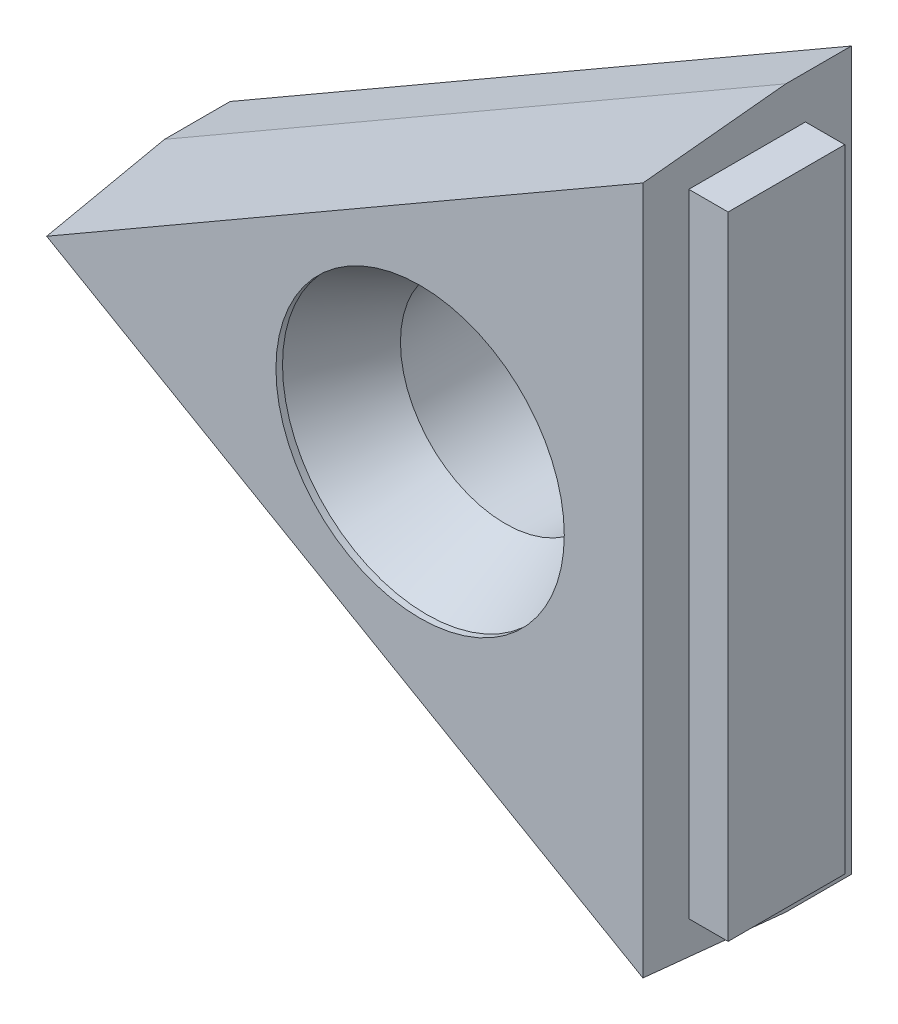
ISO-10303-21;
HEADER;
FILE_DESCRIPTION(('STEP AP214'),'2;1');
FILE_NAME('part.step','',(''),(''),'','','');
FILE_SCHEMA(('AUTOMOTIVE_DESIGN { 1 0 10303 214 1 1 1 1 }'));
ENDSEC;
DATA;
#1=APPLICATION_CONTEXT('core data for automotive mechanical design processes');
#2=APPLICATION_PROTOCOL_DEFINITION('international standard','automotive_design',2000,#1);
#3=PRODUCT_CONTEXT('',#1,'mechanical');
#4=PRODUCT('Part','Part','',(#3));
#5=PRODUCT_RELATED_PRODUCT_CATEGORY('part','',(#4));
#6=PRODUCT_DEFINITION_FORMATION('','',#4);
#7=PRODUCT_DEFINITION_CONTEXT('part definition',#1,'design');
#8=PRODUCT_DEFINITION('design','',#6,#7);
#9=PRODUCT_DEFINITION_SHAPE('','',#8);
#10=(LENGTH_UNIT() NAMED_UNIT(*) SI_UNIT(.MILLI.,.METRE.));
#11=(NAMED_UNIT(*) PLANE_ANGLE_UNIT() SI_UNIT($,.RADIAN.));
#12=(NAMED_UNIT(*) SI_UNIT($,.STERADIAN.) SOLID_ANGLE_UNIT());
#13=UNCERTAINTY_MEASURE_WITH_UNIT(LENGTH_MEASURE(1.E-05),#10,'distance_accuracy_value','');
#14=(GEOMETRIC_REPRESENTATION_CONTEXT(3) GLOBAL_UNCERTAINTY_ASSIGNED_CONTEXT((#13)) GLOBAL_UNIT_ASSIGNED_CONTEXT((#10,
#11,#12)) REPRESENTATION_CONTEXT('',''));
#15=CARTESIAN_POINT('',(0.,0.,0.));
#16=DIRECTION('',(0.,0.,1.));
#17=DIRECTION('',(1.,0.,0.));
#18=AXIS2_PLACEMENT_3D('',#15,#16,#17);
#19=CARTESIAN_POINT('',(0.,0.,0.));
#20=DIRECTION('',(0.,0.,1.));
#21=DIRECTION('',(0.,1.,0.));
#22=AXIS2_PLACEMENT_3D('',#19,#20,#21);
#23=CYLINDRICAL_SURFACE('',#22,1.6);
#24=CARTESIAN_POINT('',(0.,0.,0.));
#25=DIRECTION('',(0.,0.,1.));
#26=DIRECTION('',(0.,1.,0.));
#27=AXIS2_PLACEMENT_3D('',#24,#25,#26);
#28=CIRCLE('',#27,1.6);
#29=CARTESIAN_POINT('',(0.,1.6,0.));
#30=VERTEX_POINT('',#29);
#31=EDGE_CURVE('E18',#30,#30,#28,.F.);
#32=ORIENTED_EDGE('',*,*,#31,.T.);
#33=EDGE_LOOP('',(#32));
#34=FACE_BOUND('',#33,.T.);
#35=CARTESIAN_POINT('',(0.,0.,1.88));
#36=DIRECTION('',(0.,0.,1.));
#37=DIRECTION('',(1.,0.,0.));
#38=AXIS2_PLACEMENT_3D('',#35,#36,#37);
#39=CIRCLE('',#38,1.6);
#40=CARTESIAN_POINT('',(1.6,0.,1.88));
#41=VERTEX_POINT('',#40);
#42=EDGE_CURVE('E157',#41,#41,#39,.T.);
#43=ORIENTED_EDGE('',*,*,#42,.T.);
#44=EDGE_LOOP('',(#43));
#45=FACE_BOUND('',#44,.T.);
#46=ADVANCED_FACE('F14',(#34,#45),#23,.F.);
#47=CARTESIAN_POINT('',(4.,-5.81969071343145,3.18));
#48=DIRECTION('',(-1.,0.,0.));
#49=DIRECTION('',(0.,-1.,0.));
#50=AXIS2_PLACEMENT_3D('',#47,#48,#49);
#51=PLANE('',#50);
#52=DIRECTION('',(0.,-1.,0.));
#53=VECTOR('',#52,1.);
#54=CARTESIAN_POINT('',(3.99999999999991,-4.81969071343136,0.7));
#55=LINE('',#54,#53);
#56=CARTESIAN_POINT('',(3.99999999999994,4.81969071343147,0.7));
#57=VERTEX_POINT('',#56);
#58=CARTESIAN_POINT('',(4.,-4.81969071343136,0.7));
#59=VERTEX_POINT('',#58);
#60=EDGE_CURVE('E99',#57,#59,#55,.T.);
#61=ORIENTED_EDGE('',*,*,#60,.F.);
#62=DIRECTION('',(0.,0.,1.));
#63=VECTOR('',#62,1.);
#64=CARTESIAN_POINT('',(3.99999999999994,4.81969071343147,2.48));
#65=LINE('',#64,#63);
#66=CARTESIAN_POINT('',(4.,4.81969071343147,2.48));
#67=VERTEX_POINT('',#66);
#68=EDGE_CURVE('E81',#67,#57,#65,.F.);
#69=ORIENTED_EDGE('',*,*,#68,.F.);
#70=DIRECTION('',(0.,1.,0.));
#71=VECTOR('',#70,1.);
#72=CARTESIAN_POINT('',(4.,-4.81969071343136,2.48));
#73=LINE('',#72,#71);
#74=CARTESIAN_POINT('',(4.,-4.81969071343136,2.48));
#75=VERTEX_POINT('',#74);
#76=EDGE_CURVE('E88',#75,#67,#73,.T.);
#77=ORIENTED_EDGE('',*,*,#76,.F.);
#78=DIRECTION('',(0.,0.,1.));
#79=VECTOR('',#78,1.);
#80=CARTESIAN_POINT('',(4.,-4.81969071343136,2.48));
#81=LINE('',#80,#79);
#82=EDGE_CURVE('E107',#59,#75,#81,.T.);
#83=ORIENTED_EDGE('',*,*,#82,.F.);
#84=EDGE_LOOP('',(#61,#69,#77,#83));
#85=FACE_BOUND('',#84,.T.);
#86=ADVANCED_FACE('F16',(#85),#51,.F.);
#87=CARTESIAN_POINT('',(3.4,-4.81969071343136,2.48));
#88=DIRECTION('',(0.,0.,1.));
#89=DIRECTION('',(0.,1.,0.));
#90=AXIS2_PLACEMENT_3D('',#87,#88,#89);
#91=PLANE('',#90);
#92=DIRECTION('',(0.,1.,0.));
#93=VECTOR('',#92,1.);
#94=CARTESIAN_POINT('',(3.39999999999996,0.,2.48));
#95=LINE('',#94,#93);
#96=CARTESIAN_POINT('',(3.39999999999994,-4.81969071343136,2.48));
#97=VERTEX_POINT('',#96);
#98=CARTESIAN_POINT('',(3.39999999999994,4.81969071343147,2.48));
#99=VERTEX_POINT('',#98);
#100=EDGE_CURVE('E129',#97,#99,#95,.T.);
#101=ORIENTED_EDGE('',*,*,#100,.F.);
#102=DIRECTION('',(1.,0.,0.));
#103=VECTOR('',#102,1.);
#104=CARTESIAN_POINT('',(3.4,-4.81969071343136,2.48));
#105=LINE('',#104,#103);
#106=EDGE_CURVE('E93',#75,#97,#105,.F.);
#107=ORIENTED_EDGE('',*,*,#106,.F.);
#108=ORIENTED_EDGE('',*,*,#76,.T.);
#109=DIRECTION('',(-1.,0.,0.));
#110=VECTOR('',#109,1.);
#111=CARTESIAN_POINT('',(3.39999999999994,4.81969071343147,2.48));
#112=LINE('',#111,#110);
#113=EDGE_CURVE('E91',#99,#67,#112,.F.);
#114=ORIENTED_EDGE('',*,*,#113,.F.);
#115=EDGE_LOOP('',(#101,#107,#108,#114));
#116=FACE_BOUND('',#115,.T.);
#117=ADVANCED_FACE('F90',(#116),#91,.T.);
#118=CARTESIAN_POINT('',(3.39999999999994,4.81969071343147,2.48));
#119=DIRECTION('',(0.,1.,0.));
#120=DIRECTION('',(-1.,0.,0.));
#121=AXIS2_PLACEMENT_3D('',#118,#119,#120);
#122=PLANE('',#121);
#123=DIRECTION('',(0.,0.,1.));
#124=VECTOR('',#123,1.);
#125=CARTESIAN_POINT('',(3.39999999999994,4.81969071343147,1.59));
#126=LINE('',#125,#124);
#127=CARTESIAN_POINT('',(3.39999999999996,4.81969071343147,0.7));
#128=VERTEX_POINT('',#127);
#129=EDGE_CURVE('E98',#99,#128,#126,.F.);
#130=ORIENTED_EDGE('',*,*,#129,.F.);
#131=ORIENTED_EDGE('',*,*,#113,.T.);
#132=ORIENTED_EDGE('',*,*,#68,.T.);
#133=DIRECTION('',(-1.,0.,0.));
#134=VECTOR('',#133,1.);
#135=CARTESIAN_POINT('',(3.4,4.81969071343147,0.7));
#136=LINE('',#135,#134);
#137=EDGE_CURVE('E105',#128,#57,#136,.F.);
#138=ORIENTED_EDGE('',*,*,#137,.F.);
#139=EDGE_LOOP('',(#130,#131,#132,#138));
#140=FACE_BOUND('',#139,.T.);
#141=ADVANCED_FACE('F97',(#140),#122,.T.);
#142=CARTESIAN_POINT('',(3.4,-4.81969071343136,0.7));
#143=DIRECTION('',(0.,0.,-1.));
#144=DIRECTION('',(0.,-1.,0.));
#145=AXIS2_PLACEMENT_3D('',#142,#143,#144);
#146=PLANE('',#145);
#147=DIRECTION('',(0.,1.,0.));
#148=VECTOR('',#147,1.);
#149=CARTESIAN_POINT('',(3.39999999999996,0.,0.7));
#150=LINE('',#149,#148);
#151=CARTESIAN_POINT('',(3.4,-4.81969071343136,0.7));
#152=VERTEX_POINT('',#151);
#153=EDGE_CURVE('E132',#128,#152,#150,.F.);
#154=ORIENTED_EDGE('',*,*,#153,.F.);
#155=ORIENTED_EDGE('',*,*,#137,.T.);
#156=ORIENTED_EDGE('',*,*,#60,.T.);
#157=DIRECTION('',(1.,0.,0.));
#158=VECTOR('',#157,1.);
#159=CARTESIAN_POINT('',(3.4,-4.81969071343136,0.7));
#160=LINE('',#159,#158);
#161=EDGE_CURVE('E110',#152,#59,#160,.T.);
#162=ORIENTED_EDGE('',*,*,#161,.F.);
#163=EDGE_LOOP('',(#154,#155,#156,#162));
#164=FACE_BOUND('',#163,.T.);
#165=ADVANCED_FACE('F226',(#164),#146,.T.);
#166=CARTESIAN_POINT('',(3.4,-4.81969071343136,2.48));
#167=DIRECTION('',(0.,-1.,0.));
#168=DIRECTION('',(1.,0.,0.));
#169=AXIS2_PLACEMENT_3D('',#166,#167,#168);
#170=PLANE('',#169);
#171=DIRECTION('',(0.,0.,1.));
#172=VECTOR('',#171,1.);
#173=CARTESIAN_POINT('',(3.4,-4.81969071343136,1.59));
#174=LINE('',#173,#172);
#175=EDGE_CURVE('E134',#152,#97,#174,.T.);
#176=ORIENTED_EDGE('',*,*,#175,.F.);
#177=ORIENTED_EDGE('',*,*,#161,.T.);
#178=ORIENTED_EDGE('',*,*,#82,.T.);
#179=ORIENTED_EDGE('',*,*,#106,.T.);
#180=EDGE_LOOP('',(#176,#177,#178,#179));
#181=FACE_BOUND('',#180,.T.);
#182=ADVANCED_FACE('F218',(#181),#170,.T.);
#183=CARTESIAN_POINT('',(-6.08000000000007,0.,1.));
#184=DIRECTION('',(0.498097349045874,-0.86272991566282,-0.0871557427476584));
#185=DIRECTION('',(0.866025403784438,0.5,0.));
#186=AXIS2_PLACEMENT_3D('',#183,#184,#185);
#187=PLANE('',#186);
#188=DIRECTION('',(0.,-0.100511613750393,0.994935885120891));
#189=VECTOR('',#188,1.);
#190=CARTESIAN_POINT('',(3.39999999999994,5.47328055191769,1.));
#191=LINE('',#190,#189);
#192=CARTESIAN_POINT('',(3.39999999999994,5.47328055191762,1.00000000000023));
#193=VERTEX_POINT('',#192);
#194=CARTESIAN_POINT('',(3.39999999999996,5.25304996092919,3.18));
#195=VERTEX_POINT('',#194);
#196=EDGE_CURVE('E141',#193,#195,#191,.T.);
#197=ORIENTED_EDGE('',*,*,#196,.F.);
#198=DIRECTION('',(0.866025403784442,0.5,0.));
#199=VECTOR('',#198,1.);
#200=CARTESIAN_POINT('',(3.99999999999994,5.81969071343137,1.));
#201=LINE('',#200,#199);
#202=CARTESIAN_POINT('',(-6.08000000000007,0.,1.));
#203=VERTEX_POINT('',#202);
#204=EDGE_CURVE('E121',#193,#203,#201,.F.);
#205=ORIENTED_EDGE('',*,*,#204,.T.);
#206=DIRECTION('',(0.17235866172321,0.,0.985034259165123));
#207=VECTOR('',#206,1.);
#208=CARTESIAN_POINT('',(-6.08000000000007,0.,1.));
#209=LINE('',#208,#207);
#210=CARTESIAN_POINT('',(-5.69854942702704,0.,3.18));
#211=VERTEX_POINT('',#210);
#212=EDGE_CURVE('E115',#203,#211,#209,.T.);
#213=ORIENTED_EDGE('',*,*,#212,.T.);
#214=DIRECTION('',(-0.866025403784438,-0.5,0.));
#215=VECTOR('',#214,1.);
#216=CARTESIAN_POINT('',(3.39999999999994,5.25304996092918,3.18));
#217=LINE('',#216,#215);
#218=EDGE_CURVE('E113',#195,#211,#217,.T.);
#219=ORIENTED_EDGE('',*,*,#218,.F.);
#220=EDGE_LOOP('',(#197,#205,#213,#219));
#221=FACE_BOUND('',#220,.T.);
#222=ADVANCED_FACE('F216',(#221),#187,.F.);
#223=CARTESIAN_POINT('',(-6.08000000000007,0.,3.18));
#224=DIRECTION('',(0.,0.,1.));
#225=DIRECTION('',(0.,1.,0.));
#226=AXIS2_PLACEMENT_3D('',#223,#224,#225);
#227=PLANE('',#226);
#228=CARTESIAN_POINT('',(0.,0.,3.18));
#229=DIRECTION('',(0.,0.,1.));
#230=DIRECTION('',(1.,0.,0.));
#231=AXIS2_PLACEMENT_3D('',#228,#229,#230);
#232=CIRCLE('',#231,2.2);
#233=CARTESIAN_POINT('',(2.2,0.,3.18));
#234=VERTEX_POINT('',#233);
#235=EDGE_CURVE('E96',#234,#234,#232,.T.);
#236=ORIENTED_EDGE('',*,*,#235,.F.);
#237=EDGE_LOOP('',(#236));
#238=FACE_BOUND('',#237,.T.);
#239=DIRECTION('',(0.,1.,0.));
#240=VECTOR('',#239,1.);
#241=CARTESIAN_POINT('',(3.39999999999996,0.,3.18));
#242=LINE('',#241,#240);
#243=CARTESIAN_POINT('',(3.4,-5.25304996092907,3.18));
#244=VERTEX_POINT('',#243);
#245=EDGE_CURVE('E143',#195,#244,#242,.F.);
#246=ORIENTED_EDGE('',*,*,#245,.F.);
#247=ORIENTED_EDGE('',*,*,#218,.T.);
#248=DIRECTION('',(-0.866025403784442,0.5,0.));
#249=VECTOR('',#248,1.);
#250=CARTESIAN_POINT('',(5.80493755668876,-6.64154130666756,3.18));
#251=LINE('',#250,#249);
#252=EDGE_CURVE('E118',#211,#244,#251,.F.);
#253=ORIENTED_EDGE('',*,*,#252,.T.);
#254=EDGE_LOOP('',(#246,#247,#253));
#255=FACE_BOUND('',#254,.T.);
#256=ADVANCED_FACE('F204',(#238,#255),#227,.T.);
#257=CARTESIAN_POINT('',(5.7095749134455,-6.80671424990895,1.));
#258=DIRECTION('',(0.498097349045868,0.862729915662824,-0.0871557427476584));
#259=DIRECTION('',(-0.866025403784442,0.5,0.));
#260=AXIS2_PLACEMENT_3D('',#257,#258,#259);
#261=PLANE('',#260);
#262=DIRECTION('',(0.,-0.100511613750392,-0.994935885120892));
#263=VECTOR('',#262,1.);
#264=CARTESIAN_POINT('',(3.4,-5.25304996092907,3.18));
#265=LINE('',#264,#263);
#266=CARTESIAN_POINT('',(3.39999999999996,-5.47328055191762,0.999999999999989));
#267=VERTEX_POINT('',#266);
#268=EDGE_CURVE('E145',#244,#267,#265,.T.);
#269=ORIENTED_EDGE('',*,*,#268,.F.);
#270=ORIENTED_EDGE('',*,*,#252,.F.);
#271=ORIENTED_EDGE('',*,*,#212,.F.);
#272=DIRECTION('',(-0.866025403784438,0.5,0.));
#273=VECTOR('',#272,1.);
#274=CARTESIAN_POINT('',(-6.08000000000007,0.,1.));
#275=LINE('',#274,#273);
#276=EDGE_CURVE('E127',#203,#267,#275,.F.);
#277=ORIENTED_EDGE('',*,*,#276,.T.);
#278=EDGE_LOOP('',(#269,#270,#271,#277));
#279=FACE_BOUND('',#278,.T.);
#280=ADVANCED_FACE('F199',(#279),#261,.F.);
#281=CARTESIAN_POINT('',(3.99999999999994,5.81969071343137,3.18));
#282=DIRECTION('',(0.5,-0.866025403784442,0.));
#283=DIRECTION('',(0.866025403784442,0.5,0.));
#284=AXIS2_PLACEMENT_3D('',#281,#282,#283);
#285=PLANE('',#284);
#286=DIRECTION('',(-0.866025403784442,-0.5,0.));
#287=VECTOR('',#286,1.);
#288=CARTESIAN_POINT('',(3.39999999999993,5.4732805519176,0.));
#289=LINE('',#288,#287);
#290=CARTESIAN_POINT('',(3.39999999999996,5.47328055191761,0.));
#291=VERTEX_POINT('',#290);
#292=CARTESIAN_POINT('',(-6.08000000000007,0.,0.));
#293=VERTEX_POINT('',#292);
#294=EDGE_CURVE('E147',#291,#293,#289,.T.);
#295=ORIENTED_EDGE('',*,*,#294,.T.);
#296=DIRECTION('',(0.,0.,1.));
#297=VECTOR('',#296,1.);
#298=CARTESIAN_POINT('',(-6.08000000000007,0.,3.18));
#299=LINE('',#298,#297);
#300=EDGE_CURVE('E124',#293,#203,#299,.T.);
#301=ORIENTED_EDGE('',*,*,#300,.T.);
#302=ORIENTED_EDGE('',*,*,#204,.F.);
#303=DIRECTION('',(0.,0.,1.));
#304=VECTOR('',#303,1.);
#305=CARTESIAN_POINT('',(3.39999999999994,5.4732805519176,1.59));
#306=LINE('',#305,#304);
#307=EDGE_CURVE('E138',#291,#193,#306,.T.);
#308=ORIENTED_EDGE('',*,*,#307,.F.);
#309=EDGE_LOOP('',(#295,#301,#302,#308));
#310=FACE_BOUND('',#309,.T.);
#311=ADVANCED_FACE('F196',(#310),#285,.F.);
#312=CARTESIAN_POINT('',(-6.08000000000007,0.,3.18));
#313=DIRECTION('',(0.5,0.866025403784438,0.));
#314=DIRECTION('',(-0.866025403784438,0.5,0.));
#315=AXIS2_PLACEMENT_3D('',#312,#313,#314);
#316=PLANE('',#315);
#317=ORIENTED_EDGE('',*,*,#276,.F.);
#318=ORIENTED_EDGE('',*,*,#300,.F.);
#319=DIRECTION('',(0.866025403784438,-0.5,0.));
#320=VECTOR('',#319,1.);
#321=CARTESIAN_POINT('',(-6.08000000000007,0.,0.));
#322=LINE('',#321,#320);
#323=CARTESIAN_POINT('',(3.39999999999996,-5.47328055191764,0.));
#324=VERTEX_POINT('',#323);
#325=EDGE_CURVE('E24',#293,#324,#322,.T.);
#326=ORIENTED_EDGE('',*,*,#325,.T.);
#327=DIRECTION('',(0.,0.,1.));
#328=VECTOR('',#327,1.);
#329=CARTESIAN_POINT('',(3.4,-5.47328055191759,1.59));
#330=LINE('',#329,#328);
#331=EDGE_CURVE('E32',#267,#324,#330,.F.);
#332=ORIENTED_EDGE('',*,*,#331,.F.);
#333=EDGE_LOOP('',(#317,#318,#326,#332));
#334=FACE_BOUND('',#333,.T.);
#335=ADVANCED_FACE('F190',(#334),#316,.F.);
#336=CARTESIAN_POINT('',(3.39999999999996,0.,1.59));
#337=DIRECTION('',(1.,0.,0.));
#338=DIRECTION('',(0.,1.,0.));
#339=AXIS2_PLACEMENT_3D('',#336,#337,#338);
#340=PLANE('',#339);
#341=ORIENTED_EDGE('',*,*,#245,.T.);
#342=ORIENTED_EDGE('',*,*,#268,.T.);
#343=ORIENTED_EDGE('',*,*,#331,.T.);
#344=DIRECTION('',(0.,1.,0.));
#345=VECTOR('',#344,1.);
#346=CARTESIAN_POINT('',(3.4,0.,0.));
#347=LINE('',#346,#345);
#348=EDGE_CURVE('E9',#324,#291,#347,.T.);
#349=ORIENTED_EDGE('',*,*,#348,.T.);
#350=ORIENTED_EDGE('',*,*,#307,.T.);
#351=ORIENTED_EDGE('',*,*,#196,.T.);
#352=EDGE_LOOP('',(#341,#342,#343,#349,#350,#351));
#353=FACE_BOUND('',#352,.T.);
#354=ORIENTED_EDGE('',*,*,#153,.T.);
#355=ORIENTED_EDGE('',*,*,#175,.T.);
#356=ORIENTED_EDGE('',*,*,#100,.T.);
#357=ORIENTED_EDGE('',*,*,#129,.T.);
#358=EDGE_LOOP('',(#354,#355,#356,#357));
#359=FACE_BOUND('',#358,.T.);
#360=ADVANCED_FACE('F184',(#353,#359),#340,.T.);
#361=CARTESIAN_POINT('',(-6.08000000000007,0.,0.));
#362=DIRECTION('',(0.,0.,1.));
#363=DIRECTION('',(0.,1.,0.));
#364=AXIS2_PLACEMENT_3D('',#361,#362,#363);
#365=PLANE('',#364);
#366=ORIENTED_EDGE('',*,*,#325,.F.);
#367=ORIENTED_EDGE('',*,*,#294,.F.);
#368=ORIENTED_EDGE('',*,*,#348,.F.);
#369=EDGE_LOOP('',(#366,#367,#368));
#370=FACE_BOUND('',#369,.T.);
#371=ORIENTED_EDGE('',*,*,#31,.F.);
#372=EDGE_LOOP('',(#371));
#373=FACE_BOUND('',#372,.T.);
#374=ADVANCED_FACE('F171',(#370,#373),#365,.F.);
#375=CARTESIAN_POINT('',(0.,0.,6.19106280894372));
#376=DIRECTION('',(0.,0.,1.));
#377=DIRECTION('',(1.,0.,0.));
#378=AXIS2_PLACEMENT_3D('',#375,#376,#377);
#379=CYLINDRICAL_SURFACE('',#378,2.2);
#380=ORIENTED_EDGE('',*,*,#235,.T.);
#381=EDGE_LOOP('',(#380));
#382=FACE_BOUND('',#381,.T.);
#383=CARTESIAN_POINT('',(0.,0.,3.08000000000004));
#384=DIRECTION('',(0.,0.,1.));
#385=DIRECTION('',(1.,0.,0.));
#386=AXIS2_PLACEMENT_3D('',#383,#384,#385);
#387=CIRCLE('',#386,2.2);
#388=CARTESIAN_POINT('',(2.2,0.,3.08000000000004));
#389=VERTEX_POINT('',#388);
#390=EDGE_CURVE('E154',#389,#389,#387,.T.);
#391=ORIENTED_EDGE('',*,*,#390,.F.);
#392=EDGE_LOOP('',(#391));
#393=FACE_BOUND('',#392,.T.);
#394=ADVANCED_FACE('F164',(#382,#393),#379,.F.);
#395=CARTESIAN_POINT('',(0.,0.,1.88));
#396=DIRECTION('',(0.,0.,1.));
#397=DIRECTION('',(1.,0.,0.));
#398=AXIS2_PLACEMENT_3D('',#395,#396,#397);
#399=CONICAL_SURFACE('',#398,1.6,0.463647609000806);
#400=ORIENTED_EDGE('',*,*,#390,.T.);
#401=EDGE_LOOP('',(#400));
#402=FACE_BOUND('',#401,.T.);
#403=ORIENTED_EDGE('',*,*,#42,.F.);
#404=EDGE_LOOP('',(#403));
#405=FACE_BOUND('',#404,.T.);
#406=ADVANCED_FACE('F162',(#402,#405),#399,.F.);
#407=CLOSED_SHELL('',(#46,#86,#117,#141,#165,#182,#222,#256,#280,#311,#335,#360,#374,#394,#406));
#408=MANIFOLD_SOLID_BREP('B1',#407);
#409=ADVANCED_BREP_SHAPE_REPRESENTATION('',(#18,#408),#14);
#410=SHAPE_DEFINITION_REPRESENTATION(#9,#409);
ENDSEC;
END-ISO-10303-21;
